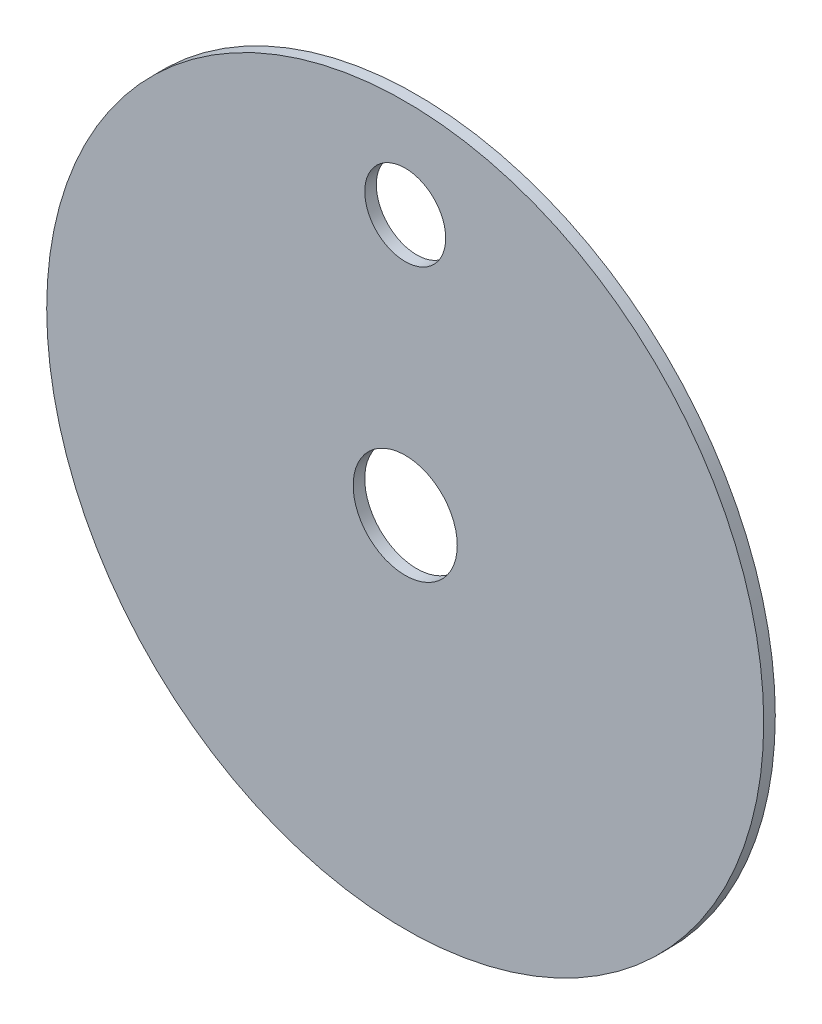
ISO-10303-21;
HEADER;
FILE_DESCRIPTION(('STEP AP214'),'2;1');
FILE_NAME('part.step','',(''),(''),'','','');
FILE_SCHEMA(('AUTOMOTIVE_DESIGN { 1 0 10303 214 1 1 1 1 }'));
ENDSEC;
DATA;
#1=APPLICATION_CONTEXT('core data for automotive mechanical design processes');
#2=APPLICATION_PROTOCOL_DEFINITION('international standard','automotive_design',2000,#1);
#3=PRODUCT_CONTEXT('',#1,'mechanical');
#4=PRODUCT('Part','Part','',(#3));
#5=PRODUCT_RELATED_PRODUCT_CATEGORY('part','',(#4));
#6=PRODUCT_DEFINITION_FORMATION('','',#4);
#7=PRODUCT_DEFINITION_CONTEXT('part definition',#1,'design');
#8=PRODUCT_DEFINITION('design','',#6,#7);
#9=PRODUCT_DEFINITION_SHAPE('','',#8);
#10=(LENGTH_UNIT() NAMED_UNIT(*) SI_UNIT(.MILLI.,.METRE.));
#11=(NAMED_UNIT(*) PLANE_ANGLE_UNIT() SI_UNIT($,.RADIAN.));
#12=(NAMED_UNIT(*) SI_UNIT($,.STERADIAN.) SOLID_ANGLE_UNIT());
#13=UNCERTAINTY_MEASURE_WITH_UNIT(LENGTH_MEASURE(1.E-05),#10,'distance_accuracy_value','');
#14=(GEOMETRIC_REPRESENTATION_CONTEXT(3) GLOBAL_UNCERTAINTY_ASSIGNED_CONTEXT((#13)) GLOBAL_UNIT_ASSIGNED_CONTEXT((#10,
#11,#12)) REPRESENTATION_CONTEXT('',''));
#15=CARTESIAN_POINT('',(0.,0.,0.));
#16=DIRECTION('',(0.,0.,1.));
#17=DIRECTION('',(1.,0.,0.));
#18=AXIS2_PLACEMENT_3D('',#15,#16,#17);
#19=CARTESIAN_POINT('',(0.,0.,0.5));
#20=DIRECTION('',(0.,0.,-1.));
#21=DIRECTION('',(-1.,0.,0.));
#22=AXIS2_PLACEMENT_3D('',#19,#20,#21);
#23=CYLINDRICAL_SURFACE('',#22,31.);
#24=CARTESIAN_POINT('',(0.,0.,0.5));
#25=DIRECTION('',(0.,0.,-1.));
#26=DIRECTION('',(1.,0.,0.));
#27=AXIS2_PLACEMENT_3D('',#24,#25,#26);
#28=CIRCLE('',#27,31.);
#29=CARTESIAN_POINT('',(31.,0.,0.5));
#30=VERTEX_POINT('',#29);
#31=EDGE_CURVE('E10',#30,#30,#28,.T.);
#32=ORIENTED_EDGE('',*,*,#31,.T.);
#33=EDGE_LOOP('',(#32));
#34=FACE_BOUND('',#33,.T.);
#35=CARTESIAN_POINT('',(0.,0.,-0.5));
#36=DIRECTION('',(0.,0.,-1.));
#37=DIRECTION('',(1.,0.,0.));
#38=AXIS2_PLACEMENT_3D('',#35,#36,#37);
#39=CIRCLE('',#38,31.);
#40=CARTESIAN_POINT('',(31.,0.,-0.5));
#41=VERTEX_POINT('',#40);
#42=EDGE_CURVE('E33',#41,#41,#39,.T.);
#43=ORIENTED_EDGE('',*,*,#42,.F.);
#44=EDGE_LOOP('',(#43));
#45=FACE_BOUND('',#44,.T.);
#46=ADVANCED_FACE('F30',(#34,#45),#23,.T.);
#47=CARTESIAN_POINT('',(0.,0.,0.5));
#48=DIRECTION('',(0.,0.,1.));
#49=DIRECTION('',(1.,0.,0.));
#50=AXIS2_PLACEMENT_3D('',#47,#48,#49);
#51=PLANE('',#50);
#52=CARTESIAN_POINT('',(0.,0.,0.5));
#53=DIRECTION('',(0.,0.,-1.));
#54=DIRECTION('',(1.,0.,0.));
#55=AXIS2_PLACEMENT_3D('',#52,#53,#54);
#56=CIRCLE('',#55,4.5);
#57=CARTESIAN_POINT('',(4.5,0.,0.5));
#58=VERTEX_POINT('',#57);
#59=EDGE_CURVE('E45',#58,#58,#56,.T.);
#60=ORIENTED_EDGE('',*,*,#59,.T.);
#61=EDGE_LOOP('',(#60));
#62=FACE_BOUND('',#61,.T.);
#63=CARTESIAN_POINT('',(0.,22.5,0.5));
#64=DIRECTION('',(0.,0.,-1.));
#65=DIRECTION('',(1.,0.,0.));
#66=AXIS2_PLACEMENT_3D('',#63,#64,#65);
#67=CIRCLE('',#66,3.5);
#68=CARTESIAN_POINT('',(3.5,22.5,0.5));
#69=VERTEX_POINT('',#68);
#70=EDGE_CURVE('E40',#69,#69,#67,.T.);
#71=ORIENTED_EDGE('',*,*,#70,.T.);
#72=EDGE_LOOP('',(#71));
#73=FACE_BOUND('',#72,.T.);
#74=ORIENTED_EDGE('',*,*,#31,.F.);
#75=EDGE_LOOP('',(#74));
#76=FACE_BOUND('',#75,.T.);
#77=ADVANCED_FACE('F54',(#62,#73,#76),#51,.T.);
#78=CARTESIAN_POINT('',(0.,0.,-0.5));
#79=DIRECTION('',(0.,0.,1.));
#80=DIRECTION('',(1.,0.,0.));
#81=AXIS2_PLACEMENT_3D('',#78,#79,#80);
#82=PLANE('',#81);
#83=CARTESIAN_POINT('',(0.,0.,-0.5));
#84=DIRECTION('',(0.,0.,-1.));
#85=DIRECTION('',(1.,0.,0.));
#86=AXIS2_PLACEMENT_3D('',#83,#84,#85);
#87=CIRCLE('',#86,4.5);
#88=CARTESIAN_POINT('',(4.5,0.,-0.5));
#89=VERTEX_POINT('',#88);
#90=EDGE_CURVE('E48',#89,#89,#87,.T.);
#91=ORIENTED_EDGE('',*,*,#90,.F.);
#92=EDGE_LOOP('',(#91));
#93=FACE_BOUND('',#92,.T.);
#94=CARTESIAN_POINT('',(0.,22.5,-0.5));
#95=DIRECTION('',(0.,0.,-1.));
#96=DIRECTION('',(1.,0.,0.));
#97=AXIS2_PLACEMENT_3D('',#94,#95,#96);
#98=CIRCLE('',#97,3.5);
#99=CARTESIAN_POINT('',(3.5,22.5,-0.5));
#100=VERTEX_POINT('',#99);
#101=EDGE_CURVE('E42',#100,#100,#98,.T.);
#102=ORIENTED_EDGE('',*,*,#101,.F.);
#103=EDGE_LOOP('',(#102));
#104=FACE_BOUND('',#103,.T.);
#105=ORIENTED_EDGE('',*,*,#42,.T.);
#106=EDGE_LOOP('',(#105));
#107=FACE_BOUND('',#106,.T.);
#108=ADVANCED_FACE('F64',(#93,#104,#107),#82,.F.);
#109=CARTESIAN_POINT('',(0.,22.5,0.5));
#110=DIRECTION('',(0.,0.,-1.));
#111=DIRECTION('',(-1.,0.,0.));
#112=AXIS2_PLACEMENT_3D('',#109,#110,#111);
#113=CYLINDRICAL_SURFACE('',#112,3.5);
#114=ORIENTED_EDGE('',*,*,#70,.F.);
#115=EDGE_LOOP('',(#114));
#116=FACE_BOUND('',#115,.T.);
#117=ORIENTED_EDGE('',*,*,#101,.T.);
#118=EDGE_LOOP('',(#117));
#119=FACE_BOUND('',#118,.T.);
#120=ADVANCED_FACE('F60',(#116,#119),#113,.F.);
#121=CARTESIAN_POINT('',(0.,0.,0.5));
#122=DIRECTION('',(0.,0.,-1.));
#123=DIRECTION('',(-1.,0.,0.));
#124=AXIS2_PLACEMENT_3D('',#121,#122,#123);
#125=CYLINDRICAL_SURFACE('',#124,4.5);
#126=ORIENTED_EDGE('',*,*,#59,.F.);
#127=EDGE_LOOP('',(#126));
#128=FACE_BOUND('',#127,.T.);
#129=ORIENTED_EDGE('',*,*,#90,.T.);
#130=EDGE_LOOP('',(#129));
#131=FACE_BOUND('',#130,.T.);
#132=ADVANCED_FACE('F57',(#128,#131),#125,.F.);
#133=CLOSED_SHELL('',(#46,#77,#108,#120,#132));
#134=MANIFOLD_SOLID_BREP('B2',#133);
#135=ADVANCED_BREP_SHAPE_REPRESENTATION('',(#18,#134),#14);
#136=SHAPE_DEFINITION_REPRESENTATION(#9,#135);
ENDSEC;
END-ISO-10303-21;
